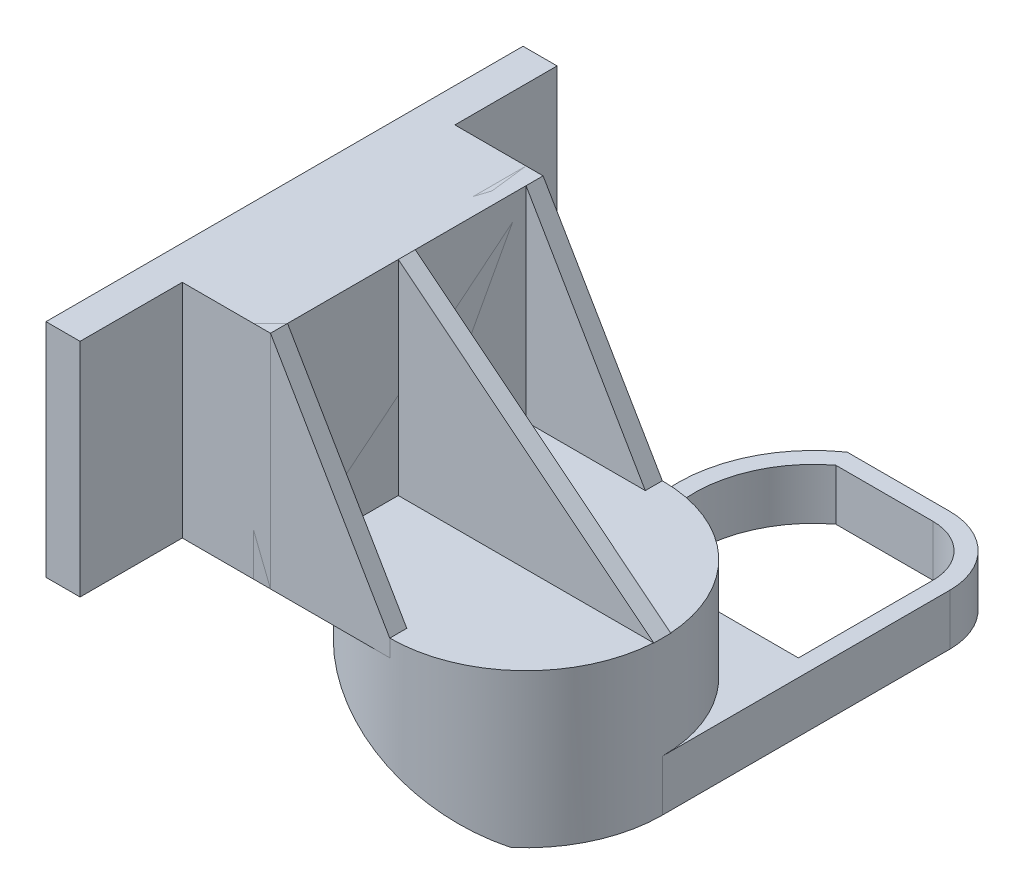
from build123d import *
from build123d.topology import SkipClean

# Parameters (mm, degrees)
SKETCH1_W                 = 3.175
SKETCH1_H                 = 25.4
BOSS_EXTRUDE6_START       = 3.175
SKETCH12_R                = 25.4
SKETCH12_R_2              = 22.225
BOSS_EXTRUDE6_DEPTH       = 3.175
SKETCH13_W                = 3.175
SKETCH13_H                = 50.8
BOSS_EXTRUDE7_DEPTH       = 38.1
BOSS_EXTRUDE8_DEPTH       = 3.175
BOSS_EXTRUDE9_DEPTH       = 3.175
BOSS_EXTRUDE10_DEPTH      = 1.5875
BOSS_EXTRUDE10_DEPTH_BACK = 1.5875
CUT_EXTRUDE5_DEPTH        = 72.915156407
BOSS_EXTRUDE11_DEPTH      = 41.275
BOSS_EXTRUDE12_START      = -9.525
BOSS_EXTRUDE12_DEPTH      = 9.525
BOSS_EXTRUDE13_DEPTH      = 3.81
BOSS_EXTRUDE16_DEPTH      = 9.525
CUT_EXTRUDE9_DEPTH        = 105.247123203
CUT_EXTRUDE10_DEPTH       = 105.247123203


with BuildPart() as part:
    # Sketch1 → Revolve1 (revolve)
    with BuildSketch(Plane.XY, mode=Mode.PRIVATE) as revolve1_sk:
        with Locations((-23.8125, -9.861626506)):
            Rectangle(SKETCH1_W, SKETCH1_H)
    revolve(revolve1_sk.sketch.rotate(Axis((0, 41.915791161, 0), (0, -1, 0)), 270), axis=Axis((0, 41.915791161, 0), (0, -1, 0)))

    # Sketch12 → Boss-Extrude6 (add)
    # profile 1 of 4: a face of its own
    with BuildSketch(Plane(origin=(0, 2.838373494, 0), x_dir=(1, 0, 0), z_dir=(0, 1, 0)).offset(BOSS_EXTRUDE6_START)):
        with Locations(Location((0, 0, 0), (0, 0, 270))):
            Circle(SKETCH12_R)
        with Locations(Location((0, 0, 0), (0, 0, 270))):
            Circle(SKETCH12_R_2, mode=Mode.SUBTRACT)
    # profile 2 of 4: a face of its own
    with BuildSketch(Plane(origin=(0, 2.838373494, 0), x_dir=(1, 0, 0), z_dir=(0, 1, 0)).offset(BOSS_EXTRUDE6_START)):
        with BuildLine():
            ThreePointArc((-25.4, 5.9e-08), (-17.960512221, 17.960512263), (0, 25.4))
            Line((0, 25.4), (-25.4, 25.4))
            Line((-25.4, 25.4), (-25.4, 5.9e-08))
        make_face()
    # profile 3 of 4: a face of its own
    with BuildSketch(Plane(origin=(0, 2.838373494, 0), x_dir=(1, 0, 0), z_dir=(0, 1, 0)).offset(BOSS_EXTRUDE6_START)):
        with BuildLine():
            ThreePointArc((0, -25.4), (-17.960512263, -17.960512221), (-25.4, 5.9e-08))
            Line((-25.4, 5.9e-08), (-25.4, -25.4))
            Line((-25.4, -25.4), (0, -25.4))
        make_face()
    # profile 4 of 4: a face of its own
    with BuildSketch(Plane(origin=(0, 2.838373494, 0), x_dir=(1, 0, 0), z_dir=(0, 1, 0)).offset(BOSS_EXTRUDE6_START)):
        with Locations(Location((0, 0, 0), (0, 0, 270))):
            Circle(SKETCH12_R_2)
    extrude(amount=-BOSS_EXTRUDE6_DEPTH)

    # Sketch13 → Boss-Extrude7 (add)
    with BuildSketch(Plane(origin=(0, 6.013373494, 0), x_dir=(1, 0, 0), z_dir=(0, 1, 0))):
        with Locations((-23.8125, 0)):
            Rectangle(SKETCH13_W, SKETCH13_H)
    extrude(amount=BOSS_EXTRUDE7_DEPTH)

    # Sketch14 → Boss-Extrude8 (add)
    with BuildSketch(Plane.XY.offset(25.4)):
        Polygon((0, 6.013373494), (-22.225, 44.113373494), (-22.225, 6.013373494), align=None)
    extrude(amount=-BOSS_EXTRUDE8_DEPTH)

    # Sketch15 → Boss-Extrude9 (add)
    with BuildSketch(Plane(origin=(0, 0, -25.4), x_dir=(-1, 0, 0), z_dir=(0, 0, -1))):
        Polygon((0, 6.013373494), (22.225, 44.113373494), (22.225, 6.013373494), align=None)
    extrude(amount=-BOSS_EXTRUDE9_DEPTH)

    # 3DSketch1 → Boss-Extrude10 (add, two sides: drawn at the far end of the back side and taken through both)
    with SkipClean():  # the faces are left unmerged after this step: merging them gives an invalid solid
        with BuildSketch(Plane(origin=(25.4, 6.013373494, 0), x_dir=(-0.7808688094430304, 0.6246950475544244, 0), z_dir=(0, 0, 1)).offset(-BOSS_EXTRUDE10_DEPTH_BACK)):
            Polygon((0, 0), (60.989758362, 0), (37.18887705, 29.75110164), align=None)
        extrude(amount=BOSS_EXTRUDE10_DEPTH + BOSS_EXTRUDE10_DEPTH_BACK)

    # Sketch18 → Cut-Extrude5 (cut, through all)
    with SkipClean():  # the faces are left unmerged after this step: merging them gives an invalid solid
        with BuildSketch(Plane.XY.offset(25.4)):
            Polygon((-25.4, -22.561626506), (16.51, -22.561626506), (-25.4, -3.511626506), align=None)
        extrude(amount=-CUT_EXTRUDE5_DEPTH, mode=Mode.SUBTRACT)

    # Sketch21 → Boss-Extrude12 (add)
    with BuildSketch(Plane.XZ.offset(22.561626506).offset(BOSS_EXTRUDE12_START)):
        with BuildLine():
            Line((25.4, -53.600174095), (25.4, 0))
            ThreePointArc((25.4, 0), (23.070695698, -10.625582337), (16.51, -19.302328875))
            ThreePointArc((16.51, -19.302328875), (5.715284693, -24.748646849), (-6.37446985, -24.587113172))
            ThreePointArc((-6.37446985, -24.587113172), (-17.306119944, -45.42863762), (-6.431880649, -66.300174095))
            Line((-6.431880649, -66.300174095), (12.7, -66.300174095))
            ThreePointArc((12.7, -66.300174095), (21.680256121, -62.580430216), (25.4, -53.600174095))
        make_face()
    extrude(amount=BOSS_EXTRUDE12_DEPTH)

    # Sketch24 → Boss-Extrude13 (add)
    with BuildSketch(Plane.XZ.offset(22.561626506)):
        with BuildLine():
            Line((-13.429011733, -65.211767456), (-8.523247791, -64.673798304))
            Line((-8.523247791, -64.673798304), (-6.37446985, -24.587113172))
            Line((-6.37446985, -24.587113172), (-10.649062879, -23.059866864))
            ThreePointArc((-10.649062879, -23.059866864), (-21.052826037, -43.541351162), (-13.429011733, -65.211767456))
        make_face()
    extrude(amount=-BOSS_EXTRUDE13_DEPTH)

    # Sketch27 → Boss-Extrude16 (add)
    with SkipClean():  # the faces are left unmerged after this step: merging them gives an invalid solid
        with BuildSketch(Plane.XZ.offset(22.561626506)):
            with BuildLine():
                Line((-10.649062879, -23.059866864), (-3.076285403, -22.011067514))
                ThreePointArc((-3.076285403, -22.011067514), (7.604897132, -20.88339447), (16.51, -14.878525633))
                Line((16.51, -14.878525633), (16.51, -26.737831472))
                Line((16.51, -26.737831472), (-10.649062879, -26.737831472))
                Line((-10.649062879, -26.737831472), (-10.649062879, -23.059866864))
            make_face()
        extrude(amount=-BOSS_EXTRUDE16_DEPTH)

    # Sketch28 → Cut-Extrude9 (cut, through all)
    with SkipClean():  # the faces are left unmerged after this step: merging them gives an invalid solid
        with BuildSketch(Plane.XZ.offset(22.561626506)):
            with BuildLine():
                Line((22.225, -53.600174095), (22.225, -28.535602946))
                Line((22.225, -28.535602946), (-6.30731293, -28.535602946))
                ThreePointArc((-6.30731293, -28.535602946), (-14.130955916, -45.372161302), (-6.446109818, -62.272523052))
                ThreePointArc((-6.446109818, -62.272523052), (-5.928335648, -62.706820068), (-5.397596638, -63.125174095))
                Line((-5.397596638, -63.125174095), (12.7, -63.125174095))
                ThreePointArc((12.7, -63.125174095), (19.435192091, -60.335366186), (22.225, -53.600174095))
            make_face()
        extrude(amount=-CUT_EXTRUDE9_DEPTH, mode=Mode.SUBTRACT)

    # Sketch29 → Cut-Extrude10 (cut, through all)
    with SkipClean():  # the faces are left unmerged after this step: merging them gives an invalid solid
        with BuildSketch(Plane.XZ.offset(22.561626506)):
            with BuildLine():
                ThreePointArc((-16.415549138, -59.52685928), (-15.190983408, -61.473048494), (-13.812236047, -63.313230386))
                ThreePointArc((-13.812236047, -63.313230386), (-12.47215539, -63.449964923), (-12.335420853, -62.109884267))
                ThreePointArc((-12.335420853, -62.109884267), (-13.621218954, -60.393759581), (-14.763229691, -58.578774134))
                ThreePointArc((-14.763229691, -58.578774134), (-16.063431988, -58.226656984), (-16.415549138, -59.52685928))
            make_face()
            with BuildLine():
                ThreePointArc((-19.561760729, -51.264731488), (-18.998535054, -53.494079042), (-18.255915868, -55.670252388))
                ThreePointArc((-18.255915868, -55.670252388), (-17.023676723, -56.214402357), (-16.479526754, -54.982163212))
                ThreePointArc((-16.479526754, -54.982163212), (-17.172081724, -52.952698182), (-17.69733713, -50.873643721))
                ThreePointArc((-17.69733713, -50.873643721), (-18.825092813, -50.136975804), (-19.561760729, -51.264731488))
            make_face()
            with BuildLine():
                ThreePointArc((-20.000847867, -42.434748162), (-20.154094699, -44.729029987), (-20.12029643, -47.028175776))
                ThreePointArc((-20.12029643, -47.028175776), (-19.11651895, -47.926475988), (-18.218218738, -46.922698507))
                ThreePointArc((-18.218218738, -46.922698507), (-18.249738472, -44.778551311), (-18.106822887, -42.638940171))
                ThreePointArc((-18.106822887, -42.638940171), (-18.951739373, -41.589831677), (-20.000847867, -42.434748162))
            make_face()
            with BuildLine():
                ThreePointArc((-17.689829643, -33.901249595), (-18.544548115, -36.035885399), (-19.222879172, -38.232947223))
                ThreePointArc((-19.222879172, -38.232947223), (-18.54582009, -39.397465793), (-17.38130152, -38.72040671))
                ThreePointArc((-17.38130152, -38.72040671), (-16.748700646, -36.671461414), (-15.951603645, -34.680733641))
                ThreePointArc((-15.951603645, -34.680733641), (-16.430974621, -33.421878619), (-17.689829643, -33.901249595))
            make_face()
            with BuildLine():
                ThreePointArc((-12.854924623, -26.499554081), (-14.327448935, -28.265590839), (-15.651509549, -30.145504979))
                ThreePointArc((-15.651509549, -30.145504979), (-15.367444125, -31.462250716), (-14.050698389, -31.178185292))
                ThreePointArc((-14.050698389, -31.178185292), (-12.815900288, -29.425006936), (-11.442647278, -27.778028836))
                ThreePointArc((-11.442647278, -27.778028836), (-11.509548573, -26.432652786), (-12.854924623, -26.499554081))
            make_face()
        extrude(amount=-CUT_EXTRUDE10_DEPTH, mode=Mode.SUBTRACT)


with BuildPart() as body_2:
    # Sketch20 → Boss-Extrude11 (new body)
    with BuildSketch(Plane(origin=(0, 44.113373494, 0), x_dir=(1, 0, 0), z_dir=(0, 1, 0))):
        Polygon((-22.225, 25.4), (-38.663264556, 25.4), (-38.663264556, 44.45), (-45.013264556, 44.45), (-45.013264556, -44.45), (-38.663264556, -44.45), (-38.663264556, -25.4), (-22.225, -25.4), align=None)
    extrude(amount=-BOSS_EXTRUDE11_DEPTH)


solid = Compound([part.part, body_2.part])
